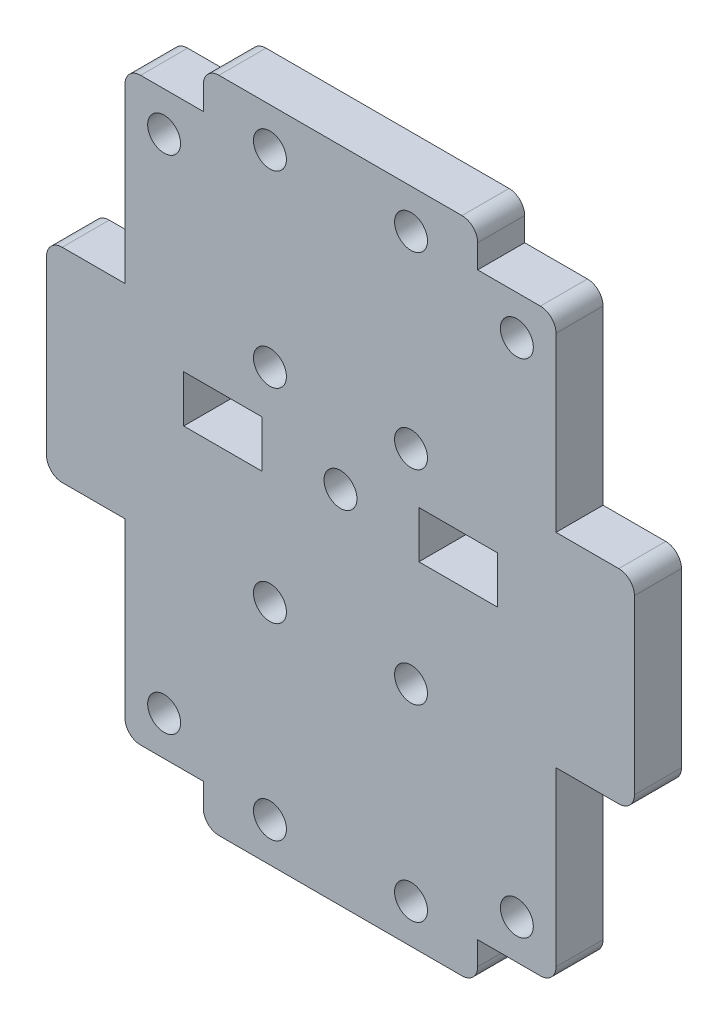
from build123d import *

# Parameters (mm, degrees)
SKETCH_1_R          = 2.1
EXTRUDE_1_DEPTH     = 6
EXTRUDE_2_DEPTH     = 6
SKETCH_3_R          = 2.1
CUT_EXTRUDE_1_DEPTH = 101.583298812


with BuildPart() as part:
    # Sketch 1 → Extrude 1 (new body)
    # profile 1 of 3: a face of its own
    with BuildSketch(Plane.XY):
        with BuildLine():
            Line((-18, 29), (0, 29))
            Line((0, 29), (0, 43))
            Line((0, 43), (-2.5, 43))
            Line((-2.5, 43), (-2.5, 49))
            Line((-2.5, 49), (0, 49))
            Line((0, 49), (0, 55))
            Line((0, 55), (-18, 55))
            ThreePointArc((-18, 55), (-19.414213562, 54.414213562), (-20, 53))
            Line((-20, 53), (-20, 31))
            ThreePointArc((-20, 31), (-19.414213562, 29.585786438), (-18, 29))
        make_face()
    # profile 2 of 3: a face of its own
    with BuildSketch(Plane.XY):
        with BuildLine():
            ThreePointArc((0, 2), (0.585786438, 0.585786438), (2, 0))
            Line((2, 0), (33, 0))
            ThreePointArc((33, 0), (34.414213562, 0.585786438), (35, 2))
            Line((35, 2), (35, 29))
            Line((35, 29), (35, 43))
            Line((35, 43), (27.5, 43))
            Line((27.5, 43), (27.5, 49))
            Line((27.5, 49), (35, 49))
            Line((35, 49), (35, 55))
            Line((35, 55), (35, 82))
            ThreePointArc((35, 82), (34.414213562, 83.414213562), (33, 84))
            Line((33, 84), (2, 84))
            ThreePointArc((2, 84), (0.585786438, 83.414213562), (0, 82))
            Line((0, 82), (0, 55))
            Line((0, 55), (0, 49))
            Line((0, 49), (7.5, 49))
            Line((7.5, 49), (7.5, 43))
            Line((7.5, 43), (0, 43))
            Line((0, 43), (0, 29))
            Line((0, 29), (0, 2))
        make_face()
        with Locations((8.5, 5)):
            Circle(SKETCH_1_R, mode=Mode.SUBTRACT)
        with Locations((8.5, 29)):
            Circle(SKETCH_1_R, mode=Mode.SUBTRACT)
        with Locations((26.5, 5)):
            Circle(SKETCH_1_R, mode=Mode.SUBTRACT)
        with Locations((26.5, 29)):
            Circle(SKETCH_1_R, mode=Mode.SUBTRACT)
        with Locations((8.5, 55)):
            Circle(SKETCH_1_R, mode=Mode.SUBTRACT)
        with Locations((8.5, 79)):
            Circle(SKETCH_1_R, mode=Mode.SUBTRACT)
        with Locations((17.5, 46)):
            Circle(SKETCH_1_R, mode=Mode.SUBTRACT)
        with Locations((26.5, 55)):
            Circle(SKETCH_1_R, mode=Mode.SUBTRACT)
        with Locations((26.5, 79)):
            Circle(SKETCH_1_R, mode=Mode.SUBTRACT)
    # profile 3 of 3: a face of its own
    with BuildSketch(Plane.XY):
        with BuildLine():
            Line((35, 43), (35, 29))
            Line((35, 29), (53, 29))
            ThreePointArc((53, 29), (54.414213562, 29.585786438), (55, 31))
            Line((55, 31), (55, 53))
            ThreePointArc((55, 53), (54.414213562, 54.414213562), (53, 55))
            Line((53, 55), (35, 55))
            Line((35, 55), (35, 49))
            Line((35, 49), (37.5, 49))
            Line((37.5, 49), (37.5, 43))
            Line((37.5, 43), (35, 43))
        make_face()
    extrude(amount=EXTRUDE_1_DEPTH)

    # Sketch 2 → Extrude 2 (add)
    with BuildSketch(Plane.XY.offset(6)):
        with BuildLine():
            Line((0, 79), (-8, 79))
            ThreePointArc((-8, 79), (-9.414213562, 78.414213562), (-10, 77))
            Line((-10, 77), (-10, 55))
            ThreePointArc((-10, 55), (-9.414213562, 53.585786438), (-8, 53))
            Line((-8, 53), (0, 53))
            Line((0, 53), (0, 79))
        make_face()
        with BuildLine():
            Line((45, 77), (45, 55))
            ThreePointArc((45, 55), (44.414213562, 53.585786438), (43, 53))
            Line((43, 53), (35, 53))
            Line((35, 53), (35, 79))
            Line((35, 79), (43, 79))
            ThreePointArc((43, 79), (44.414213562, 78.414213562), (45, 77))
        make_face()
        with BuildLine():
            Line((35, 5), (43, 5))
            ThreePointArc((43, 5), (44.414213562, 5.585786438), (45, 7))
            Line((45, 7), (45, 29))
            ThreePointArc((45, 29), (44.414213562, 30.414213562), (43, 31))
            Line((43, 31), (35, 31))
            Line((35, 31), (35, 5))
        make_face()
        with BuildLine():
            Line((-10, 7), (-10, 29))
            ThreePointArc((-10, 29), (-9.414213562, 30.414213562), (-8, 31))
            Line((-8, 31), (0, 31))
            Line((0, 31), (0, 5))
            Line((0, 5), (-8, 5))
            ThreePointArc((-8, 5), (-9.414213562, 5.585786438), (-10, 7))
        make_face()
    extrude(amount=-EXTRUDE_2_DEPTH)

    # Sketch 3 → Cut-Extrude 1 (cut, through all)
    with BuildSketch(Plane.XY.offset(6)):
        with Locations((-5, 74)):
            Circle(SKETCH_3_R)
        with Locations((40, 74)):
            Circle(SKETCH_3_R)
        with Locations((-5, 10)):
            Circle(SKETCH_3_R)
        with Locations((40, 10)):
            Circle(SKETCH_3_R)
    extrude(amount=-CUT_EXTRUDE_1_DEPTH, mode=Mode.SUBTRACT)


solid = part.part
